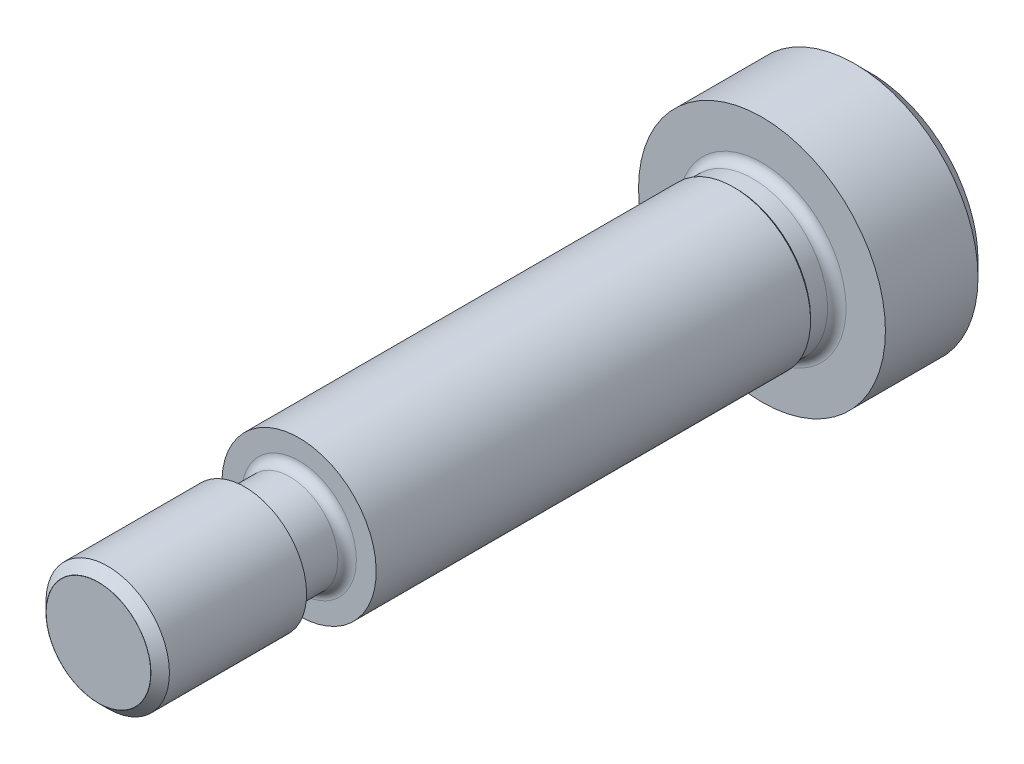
ISO-10303-21;
HEADER;
FILE_DESCRIPTION(('STEP AP214'),'2;1');
FILE_NAME('part.step','',(''),(''),'','','');
FILE_SCHEMA(('AUTOMOTIVE_DESIGN { 1 0 10303 214 1 1 1 1 }'));
ENDSEC;
DATA;
#1=APPLICATION_CONTEXT('core data for automotive mechanical design processes');
#2=APPLICATION_PROTOCOL_DEFINITION('international standard','automotive_design',2000,#1);
#3=PRODUCT_CONTEXT('',#1,'mechanical');
#4=PRODUCT('Part','Part','',(#3));
#5=PRODUCT_RELATED_PRODUCT_CATEGORY('part','',(#4));
#6=PRODUCT_DEFINITION_FORMATION('','',#4);
#7=PRODUCT_DEFINITION_CONTEXT('part definition',#1,'design');
#8=PRODUCT_DEFINITION('design','',#6,#7);
#9=PRODUCT_DEFINITION_SHAPE('','',#8);
#10=(LENGTH_UNIT() NAMED_UNIT(*) SI_UNIT(.MILLI.,.METRE.));
#11=(NAMED_UNIT(*) PLANE_ANGLE_UNIT() SI_UNIT($,.RADIAN.));
#12=(NAMED_UNIT(*) SI_UNIT($,.STERADIAN.) SOLID_ANGLE_UNIT());
#13=UNCERTAINTY_MEASURE_WITH_UNIT(LENGTH_MEASURE(1.E-05),#10,'distance_accuracy_value','');
#14=(GEOMETRIC_REPRESENTATION_CONTEXT(3) GLOBAL_UNCERTAINTY_ASSIGNED_CONTEXT((#13)) GLOBAL_UNIT_ASSIGNED_CONTEXT((#10,
#11,#12)) REPRESENTATION_CONTEXT('',''));
#15=CARTESIAN_POINT('',(0.,0.,0.));
#16=DIRECTION('',(0.,0.,1.));
#17=DIRECTION('',(1.,0.,0.));
#18=AXIS2_PLACEMENT_3D('',#15,#16,#17);
#19=CARTESIAN_POINT('',(0.,8.,0.));
#20=DIRECTION('',(0.,0.,-1.));
#21=DIRECTION('',(0.,1.,0.));
#22=AXIS2_PLACEMENT_3D('',#19,#20,#21);
#23=PLANE('',#22);
#24=CARTESIAN_POINT('',(0.,0.,0.));
#25=DIRECTION('',(0.,0.,1.));
#26=DIRECTION('',(0.,-1.,0.));
#27=AXIS2_PLACEMENT_3D('',#24,#25,#26);
#28=CIRCLE('',#27,5.45);
#29=CARTESIAN_POINT('',(0.,-5.45,0.));
#30=VERTEX_POINT('',#29);
#31=EDGE_CURVE('E211',#30,#30,#28,.T.);
#32=ORIENTED_EDGE('',*,*,#31,.F.);
#33=EDGE_LOOP('',(#32));
#34=FACE_BOUND('',#33,.T.);
#35=CARTESIAN_POINT('',(0.,0.,0.));
#36=DIRECTION('',(0.,0.,1.));
#37=DIRECTION('',(0.,-1.,0.));
#38=AXIS2_PLACEMENT_3D('',#35,#36,#37);
#39=CIRCLE('',#38,8.);
#40=CARTESIAN_POINT('',(0.,-8.,0.));
#41=VERTEX_POINT('',#40);
#42=EDGE_CURVE('E149',#41,#41,#39,.T.);
#43=ORIENTED_EDGE('',*,*,#42,.T.);
#44=EDGE_LOOP('',(#43));
#45=FACE_BOUND('',#44,.T.);
#46=ADVANCED_FACE('F36',(#34,#45),#23,.F.);
#47=CARTESIAN_POINT('',(0.,0.,0.6));
#48=DIRECTION('',(0.,0.,1.));
#49=DIRECTION('',(0.,-1.,0.));
#50=AXIS2_PLACEMENT_3D('',#47,#48,#49);
#51=TOROIDAL_SURFACE('',#50,5.45,0.6);
#52=CARTESIAN_POINT('',(0.,0.,0.6));
#53=DIRECTION('',(0.,0.,1.));
#54=DIRECTION('',(0.,-1.,0.));
#55=AXIS2_PLACEMENT_3D('',#52,#53,#54);
#56=CIRCLE('',#55,4.85);
#57=CARTESIAN_POINT('',(0.,-4.85,0.6));
#58=VERTEX_POINT('',#57);
#59=EDGE_CURVE('E208',#58,#58,#56,.T.);
#60=ORIENTED_EDGE('',*,*,#59,.F.);
#61=EDGE_LOOP('',(#60));
#62=FACE_BOUND('',#61,.T.);
#63=ORIENTED_EDGE('',*,*,#31,.T.);
#64=EDGE_LOOP('',(#63));
#65=FACE_BOUND('',#64,.T.);
#66=ADVANCED_FACE('F274',(#62,#65),#51,.F.);
#67=CARTESIAN_POINT('',(0.,0.,-1.49784845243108));
#68=DIRECTION('',(0.,0.,1.));
#69=DIRECTION('',(0.,-1.,0.));
#70=AXIS2_PLACEMENT_3D('',#67,#68,#69);
#71=CYLINDRICAL_SURFACE('',#70,4.85);
#72=CARTESIAN_POINT('',(0.,0.,1.7));
#73=DIRECTION('',(0.,0.,1.));
#74=DIRECTION('',(0.,-1.,0.));
#75=AXIS2_PLACEMENT_3D('',#72,#73,#74);
#76=CIRCLE('',#75,4.85);
#77=CARTESIAN_POINT('',(0.,-4.85,1.7));
#78=VERTEX_POINT('',#77);
#79=EDGE_CURVE('E205',#78,#78,#76,.T.);
#80=ORIENTED_EDGE('',*,*,#79,.F.);
#81=EDGE_LOOP('',(#80));
#82=FACE_BOUND('',#81,.T.);
#83=ORIENTED_EDGE('',*,*,#59,.T.);
#84=EDGE_LOOP('',(#83));
#85=FACE_BOUND('',#84,.T.);
#86=ADVANCED_FACE('F279',(#82,#85),#71,.T.);
#87=CARTESIAN_POINT('',(0.,0.,1.7));
#88=DIRECTION('',(0.,0.,1.));
#89=DIRECTION('',(0.,-1.,0.));
#90=AXIS2_PLACEMENT_3D('',#87,#88,#89);
#91=CONICAL_SURFACE('',#90,4.85,0.785398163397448);
#92=CARTESIAN_POINT('',(0.,0.,1.85));
#93=DIRECTION('',(0.,0.,1.));
#94=DIRECTION('',(0.,-1.,0.));
#95=AXIS2_PLACEMENT_3D('',#92,#93,#94);
#96=CIRCLE('',#95,5.);
#97=CARTESIAN_POINT('',(0.,-5.,1.85));
#98=VERTEX_POINT('',#97);
#99=EDGE_CURVE('E202',#98,#98,#96,.T.);
#100=ORIENTED_EDGE('',*,*,#99,.F.);
#101=EDGE_LOOP('',(#100));
#102=FACE_BOUND('',#101,.T.);
#103=ORIENTED_EDGE('',*,*,#79,.T.);
#104=EDGE_LOOP('',(#103));
#105=FACE_BOUND('',#104,.T.);
#106=ADVANCED_FACE('F346',(#102,#105),#91,.T.);
#107=CARTESIAN_POINT('',(0.,0.,-1.49784845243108));
#108=DIRECTION('',(0.,0.,1.));
#109=DIRECTION('',(0.,-1.,0.));
#110=AXIS2_PLACEMENT_3D('',#107,#108,#109);
#111=CYLINDRICAL_SURFACE('',#110,5.);
#112=CARTESIAN_POINT('',(0.,0.,30.));
#113=DIRECTION('',(0.,0.,1.));
#114=DIRECTION('',(0.,-1.,0.));
#115=AXIS2_PLACEMENT_3D('',#112,#113,#114);
#116=CIRCLE('',#115,5.);
#117=CARTESIAN_POINT('',(0.,-5.,30.));
#118=VERTEX_POINT('',#117);
#119=EDGE_CURVE('E199',#118,#118,#116,.T.);
#120=ORIENTED_EDGE('',*,*,#119,.F.);
#121=EDGE_LOOP('',(#120));
#122=FACE_BOUND('',#121,.T.);
#123=ORIENTED_EDGE('',*,*,#99,.T.);
#124=EDGE_LOOP('',(#123));
#125=FACE_BOUND('',#124,.T.);
#126=ADVANCED_FACE('F342',(#122,#125),#111,.T.);
#127=CARTESIAN_POINT('',(0.,5.,30.));
#128=DIRECTION('',(0.,0.,-1.));
#129=DIRECTION('',(0.,1.,0.));
#130=AXIS2_PLACEMENT_3D('',#127,#128,#129);
#131=PLANE('',#130);
#132=CARTESIAN_POINT('',(0.,0.,30.));
#133=DIRECTION('',(0.,0.,1.));
#134=DIRECTION('',(0.,-1.,0.));
#135=AXIS2_PLACEMENT_3D('',#132,#133,#134);
#136=CIRCLE('',#135,3.715);
#137=CARTESIAN_POINT('',(0.,-3.715,30.));
#138=VERTEX_POINT('',#137);
#139=EDGE_CURVE('E196',#138,#138,#136,.T.);
#140=ORIENTED_EDGE('',*,*,#139,.F.);
#141=EDGE_LOOP('',(#140));
#142=FACE_BOUND('',#141,.T.);
#143=ORIENTED_EDGE('',*,*,#119,.T.);
#144=EDGE_LOOP('',(#143));
#145=FACE_BOUND('',#144,.T.);
#146=ADVANCED_FACE('F338',(#142,#145),#131,.F.);
#147=CARTESIAN_POINT('',(0.,0.,30.6));
#148=DIRECTION('',(0.,0.,1.));
#149=DIRECTION('',(0.,-1.,0.));
#150=AXIS2_PLACEMENT_3D('',#147,#148,#149);
#151=TOROIDAL_SURFACE('',#150,3.715,0.600000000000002);
#152=CARTESIAN_POINT('',(0.,0.,30.6));
#153=DIRECTION('',(0.,0.,1.));
#154=DIRECTION('',(0.,-1.,0.));
#155=AXIS2_PLACEMENT_3D('',#152,#153,#154);
#156=CIRCLE('',#155,3.115);
#157=CARTESIAN_POINT('',(0.,-3.115,30.6));
#158=VERTEX_POINT('',#157);
#159=EDGE_CURVE('E193',#158,#158,#156,.T.);
#160=ORIENTED_EDGE('',*,*,#159,.F.);
#161=EDGE_LOOP('',(#160));
#162=FACE_BOUND('',#161,.T.);
#163=ORIENTED_EDGE('',*,*,#139,.T.);
#164=EDGE_LOOP('',(#163));
#165=FACE_BOUND('',#164,.T.);
#166=ADVANCED_FACE('F334',(#162,#165),#151,.F.);
#167=CARTESIAN_POINT('',(0.,0.,-1.49784845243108));
#168=DIRECTION('',(0.,0.,1.));
#169=DIRECTION('',(0.,-1.,0.));
#170=AXIS2_PLACEMENT_3D('',#167,#168,#169);
#171=CYLINDRICAL_SURFACE('',#170,3.115);
#172=CARTESIAN_POINT('',(0.,0.,33.));
#173=DIRECTION('',(0.,0.,1.));
#174=DIRECTION('',(0.,-1.,0.));
#175=AXIS2_PLACEMENT_3D('',#172,#173,#174);
#176=CIRCLE('',#175,3.115);
#177=CARTESIAN_POINT('',(0.,-3.115,33.));
#178=VERTEX_POINT('',#177);
#179=EDGE_CURVE('E190',#178,#178,#176,.T.);
#180=ORIENTED_EDGE('',*,*,#179,.F.);
#181=EDGE_LOOP('',(#180));
#182=FACE_BOUND('',#181,.T.);
#183=ORIENTED_EDGE('',*,*,#159,.T.);
#184=EDGE_LOOP('',(#183));
#185=FACE_BOUND('',#184,.T.);
#186=ADVANCED_FACE('F330',(#182,#185),#171,.T.);
#187=CARTESIAN_POINT('',(0.,0.,33.));
#188=DIRECTION('',(0.,0.,1.));
#189=DIRECTION('',(0.,-1.,0.));
#190=AXIS2_PLACEMENT_3D('',#187,#188,#189);
#191=CONICAL_SURFACE('',#190,3.115,1.04719755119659);
#192=CARTESIAN_POINT('',(0.,0.,33.5109549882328));
#193=DIRECTION('',(0.,0.,1.));
#194=DIRECTION('',(0.,-1.,0.));
#195=AXIS2_PLACEMENT_3D('',#192,#193,#194);
#196=CIRCLE('',#195,4.);
#197=CARTESIAN_POINT('',(0.,-4.,33.5109549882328));
#198=VERTEX_POINT('',#197);
#199=EDGE_CURVE('E187',#198,#198,#196,.T.);
#200=ORIENTED_EDGE('',*,*,#199,.F.);
#201=EDGE_LOOP('',(#200));
#202=FACE_BOUND('',#201,.T.);
#203=ORIENTED_EDGE('',*,*,#179,.T.);
#204=EDGE_LOOP('',(#203));
#205=FACE_BOUND('',#204,.T.);
#206=ADVANCED_FACE('F326',(#202,#205),#191,.T.);
#207=CARTESIAN_POINT('',(0.,0.,-1.49784845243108));
#208=DIRECTION('',(0.,0.,1.));
#209=DIRECTION('',(0.,-1.,0.));
#210=AXIS2_PLACEMENT_3D('',#207,#208,#209);
#211=CYLINDRICAL_SURFACE('',#210,4.);
#212=CARTESIAN_POINT('',(0.,0.,42.4));
#213=DIRECTION('',(0.,0.,1.));
#214=DIRECTION('',(0.,-1.,0.));
#215=AXIS2_PLACEMENT_3D('',#212,#213,#214);
#216=CIRCLE('',#215,4.);
#217=CARTESIAN_POINT('',(0.,-4.,42.4));
#218=VERTEX_POINT('',#217);
#219=EDGE_CURVE('E184',#218,#218,#216,.T.);
#220=ORIENTED_EDGE('',*,*,#219,.F.);
#221=EDGE_LOOP('',(#220));
#222=FACE_BOUND('',#221,.T.);
#223=ORIENTED_EDGE('',*,*,#199,.T.);
#224=EDGE_LOOP('',(#223));
#225=FACE_BOUND('',#224,.T.);
#226=ADVANCED_FACE('F322',(#222,#225),#211,.T.);
#227=CARTESIAN_POINT('',(0.,0.,42.4));
#228=DIRECTION('',(0.,0.,-1.));
#229=DIRECTION('',(0.,1.,0.));
#230=AXIS2_PLACEMENT_3D('',#227,#228,#229);
#231=CONICAL_SURFACE('',#230,4.,0.785398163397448);
#232=CARTESIAN_POINT('',(0.,0.,43.));
#233=DIRECTION('',(0.,0.,1.));
#234=DIRECTION('',(0.,-1.,0.));
#235=AXIS2_PLACEMENT_3D('',#232,#233,#234);
#236=CIRCLE('',#235,3.4);
#237=CARTESIAN_POINT('',(0.,-3.4,43.));
#238=VERTEX_POINT('',#237);
#239=EDGE_CURVE('E181',#238,#238,#236,.T.);
#240=ORIENTED_EDGE('',*,*,#239,.F.);
#241=EDGE_LOOP('',(#240));
#242=FACE_BOUND('',#241,.T.);
#243=ORIENTED_EDGE('',*,*,#219,.T.);
#244=EDGE_LOOP('',(#243));
#245=FACE_BOUND('',#244,.T.);
#246=ADVANCED_FACE('F318',(#242,#245),#231,.T.);
#247=CARTESIAN_POINT('',(0.,0.,-1.49784845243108));
#248=DIRECTION('',(0.,0.,1.));
#249=DIRECTION('',(0.,-1.,0.));
#250=AXIS2_PLACEMENT_3D('',#247,#248,#249);
#251=CYLINDRICAL_SURFACE('',#250,3.4);
#252=CARTESIAN_POINT('',(0.,0.,33.1760918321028));
#253=DIRECTION('',(0.,0.,1.));
#254=DIRECTION('',(0.,-1.,0.));
#255=AXIS2_PLACEMENT_3D('',#252,#253,#254);
#256=CIRCLE('',#255,3.4);
#257=CARTESIAN_POINT('',(0.,-3.4,33.1760918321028));
#258=VERTEX_POINT('',#257);
#259=EDGE_CURVE('E178',#258,#258,#256,.T.);
#260=ORIENTED_EDGE('',*,*,#259,.F.);
#261=EDGE_LOOP('',(#260));
#262=FACE_BOUND('',#261,.T.);
#263=ORIENTED_EDGE('',*,*,#239,.T.);
#264=EDGE_LOOP('',(#263));
#265=FACE_BOUND('',#264,.T.);
#266=ADVANCED_FACE('F314',(#262,#265),#251,.F.);
#267=CARTESIAN_POINT('',(0.,0.,33.1760918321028));
#268=DIRECTION('',(0.,0.,1.));
#269=DIRECTION('',(0.,-1.,0.));
#270=AXIS2_PLACEMENT_3D('',#267,#268,#269);
#271=CONICAL_SURFACE('',#270,3.4,1.04719755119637);
#272=CARTESIAN_POINT('',(0.,0.,33.1703183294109));
#273=DIRECTION('',(0.,0.,1.));
#274=DIRECTION('',(0.,-1.,0.));
#275=AXIS2_PLACEMENT_3D('',#272,#273,#274);
#276=CIRCLE('',#275,3.38999999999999);
#277=CARTESIAN_POINT('',(0.,-3.38999999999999,33.1703183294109));
#278=VERTEX_POINT('',#277);
#279=EDGE_CURVE('E175',#278,#278,#276,.T.);
#280=ORIENTED_EDGE('',*,*,#279,.F.);
#281=EDGE_LOOP('',(#280));
#282=FACE_BOUND('',#281,.T.);
#283=ORIENTED_EDGE('',*,*,#259,.T.);
#284=EDGE_LOOP('',(#283));
#285=FACE_BOUND('',#284,.T.);
#286=ADVANCED_FACE('F310',(#282,#285),#271,.F.);
#287=CARTESIAN_POINT('',(0.,0.,-1.49784845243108));
#288=DIRECTION('',(0.,0.,1.));
#289=DIRECTION('',(0.,-1.,0.));
#290=AXIS2_PLACEMENT_3D('',#287,#288,#289);
#291=CYLINDRICAL_SURFACE('',#290,3.38999999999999);
#292=CARTESIAN_POINT('',(0.,0.,43.));
#293=DIRECTION('',(0.,0.,1.));
#294=DIRECTION('',(0.,-1.,0.));
#295=AXIS2_PLACEMENT_3D('',#292,#293,#294);
#296=CIRCLE('',#295,3.38999999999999);
#297=CARTESIAN_POINT('',(0.,-3.38999999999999,43.));
#298=VERTEX_POINT('',#297);
#299=EDGE_CURVE('E171',#298,#298,#296,.T.);
#300=ORIENTED_EDGE('',*,*,#299,.F.);
#301=EDGE_LOOP('',(#300));
#302=FACE_BOUND('',#301,.T.);
#303=ORIENTED_EDGE('',*,*,#279,.T.);
#304=EDGE_LOOP('',(#303));
#305=FACE_BOUND('',#304,.T.);
#306=ADVANCED_FACE('F302',(#302,#305),#291,.T.);
#307=CARTESIAN_POINT('',(0.,3.38999999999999,43.));
#308=DIRECTION('',(0.,0.,-1.));
#309=DIRECTION('',(0.,1.,0.));
#310=AXIS2_PLACEMENT_3D('',#307,#308,#309);
#311=PLANE('',#310);
#312=ORIENTED_EDGE('',*,*,#299,.T.);
#313=EDGE_LOOP('',(#312));
#314=FACE_BOUND('',#313,.T.);
#315=ADVANCED_FACE('F297',(#314),#311,.F.);
#316=CARTESIAN_POINT('',(0.,2.5,-7.));
#317=DIRECTION('',(0.,0.,1.));
#318=DIRECTION('',(0.,-1.,0.));
#319=AXIS2_PLACEMENT_3D('',#316,#317,#318);
#320=PLANE('',#319);
#321=CARTESIAN_POINT('',(0.,0.,-7.));
#322=DIRECTION('',(0.,0.,1.));
#323=DIRECTION('',(0.,-1.,0.));
#324=AXIS2_PLACEMENT_3D('',#321,#322,#323);
#325=CIRCLE('',#324,7.00000000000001);
#326=CARTESIAN_POINT('',(0.,-7.00000000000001,-7.));
#327=VERTEX_POINT('',#326);
#328=EDGE_CURVE('E166',#327,#327,#325,.T.);
#329=ORIENTED_EDGE('',*,*,#328,.F.);
#330=EDGE_LOOP('',(#329));
#331=FACE_BOUND('',#330,.T.);
#332=DIRECTION('',(0.5,-0.866025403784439,0.));
#333=VECTOR('',#332,1.);
#334=CARTESIAN_POINT('',(-3.24759526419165,0.625000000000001,-7.));
#335=LINE('',#334,#333);
#336=CARTESIAN_POINT('',(-2.88675134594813,0.,-7.));
#337=VERTEX_POINT('',#336);
#338=CARTESIAN_POINT('',(-1.44337567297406,-2.50000000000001,-7.));
#339=VERTEX_POINT('',#338);
#340=EDGE_CURVE('E57',#337,#339,#335,.T.);
#341=ORIENTED_EDGE('',*,*,#340,.T.);
#342=DIRECTION('',(1.,0.,0.));
#343=VECTOR('',#342,1.);
#344=CARTESIAN_POINT('',(0.,-2.5,-7.));
#345=LINE('',#344,#343);
#346=CARTESIAN_POINT('',(1.44337567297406,-2.5,-7.00000000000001));
#347=VERTEX_POINT('',#346);
#348=EDGE_CURVE('E11',#339,#347,#345,.T.);
#349=ORIENTED_EDGE('',*,*,#348,.T.);
#350=DIRECTION('',(0.5,0.866025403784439,0.));
#351=VECTOR('',#350,1.);
#352=CARTESIAN_POINT('',(3.24759526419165,0.625000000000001,-7.));
#353=LINE('',#352,#351);
#354=CARTESIAN_POINT('',(2.88675134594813,0.,-7.));
#355=VERTEX_POINT('',#354);
#356=EDGE_CURVE('E43',#347,#355,#353,.T.);
#357=ORIENTED_EDGE('',*,*,#356,.T.);
#358=DIRECTION('',(-0.5,0.866025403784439,0.));
#359=VECTOR('',#358,1.);
#360=CARTESIAN_POINT('',(1.08253175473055,3.125,-7.));
#361=LINE('',#360,#359);
#362=CARTESIAN_POINT('',(1.44337567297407,2.5,-6.99999999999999));
#363=VERTEX_POINT('',#362);
#364=EDGE_CURVE('E219',#355,#363,#361,.T.);
#365=ORIENTED_EDGE('',*,*,#364,.T.);
#366=DIRECTION('',(-1.,0.,0.));
#367=VECTOR('',#366,1.);
#368=CARTESIAN_POINT('',(0.,2.5,-7.));
#369=LINE('',#368,#367);
#370=CARTESIAN_POINT('',(-1.44337567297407,2.5,-6.99999999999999));
#371=VERTEX_POINT('',#370);
#372=EDGE_CURVE('E217',#363,#371,#369,.T.);
#373=ORIENTED_EDGE('',*,*,#372,.T.);
#374=DIRECTION('',(-0.5,-0.866025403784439,0.));
#375=VECTOR('',#374,1.);
#376=CARTESIAN_POINT('',(-1.08253175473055,3.125,-7.));
#377=LINE('',#376,#375);
#378=EDGE_CURVE('E215',#371,#337,#377,.T.);
#379=ORIENTED_EDGE('',*,*,#378,.T.);
#380=EDGE_LOOP('',(#341,#349,#357,#365,#373,#379));
#381=FACE_BOUND('',#380,.T.);
#382=ADVANCED_FACE('F222',(#331,#381),#320,.F.);
#383=CARTESIAN_POINT('',(0.,0.,-7.));
#384=DIRECTION('',(0.,0.,1.));
#385=DIRECTION('',(0.,-1.,0.));
#386=AXIS2_PLACEMENT_3D('',#383,#384,#385);
#387=CONICAL_SURFACE('',#386,7.00000000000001,0.785398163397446);
#388=CARTESIAN_POINT('',(0.,0.,-6.));
#389=DIRECTION('',(0.,0.,1.));
#390=DIRECTION('',(0.,-1.,0.));
#391=AXIS2_PLACEMENT_3D('',#388,#389,#390);
#392=CIRCLE('',#391,8.);
#393=CARTESIAN_POINT('',(0.,-8.,-6.));
#394=VERTEX_POINT('',#393);
#395=EDGE_CURVE('E163',#394,#394,#392,.T.);
#396=ORIENTED_EDGE('',*,*,#395,.F.);
#397=EDGE_LOOP('',(#396));
#398=FACE_BOUND('',#397,.T.);
#399=ORIENTED_EDGE('',*,*,#328,.T.);
#400=EDGE_LOOP('',(#399));
#401=FACE_BOUND('',#400,.T.);
#402=ADVANCED_FACE('F287',(#398,#401),#387,.T.);
#403=CARTESIAN_POINT('',(0.,0.,-1.49784845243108));
#404=DIRECTION('',(0.,0.,1.));
#405=DIRECTION('',(0.,-1.,0.));
#406=AXIS2_PLACEMENT_3D('',#403,#404,#405);
#407=CYLINDRICAL_SURFACE('',#406,8.);
#408=ORIENTED_EDGE('',*,*,#42,.F.);
#409=EDGE_LOOP('',(#408));
#410=FACE_BOUND('',#409,.T.);
#411=ORIENTED_EDGE('',*,*,#395,.T.);
#412=EDGE_LOOP('',(#411));
#413=FACE_BOUND('',#412,.T.);
#414=ADVANCED_FACE('F272',(#410,#413),#407,.T.);
#415=CARTESIAN_POINT('',(0.,0.,-3.00000000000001));
#416=DIRECTION('',(0.,0.,-1.));
#417=DIRECTION('',(0.,1.,0.));
#418=AXIS2_PLACEMENT_3D('',#415,#416,#417);
#419=PLANE('',#418);
#420=CARTESIAN_POINT('',(0.,0.,-3.));
#421=DIRECTION('',(0.,0.,1.));
#422=DIRECTION('',(0.,-1.,0.));
#423=AXIS2_PLACEMENT_3D('',#420,#421,#422);
#424=CIRCLE('',#423,2.5);
#425=CARTESIAN_POINT('',(0.,2.49999999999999,-3.));
#426=VERTEX_POINT('',#425);
#427=CARTESIAN_POINT('',(-2.16506350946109,1.25,-3.));
#428=VERTEX_POINT('',#427);
#429=EDGE_CURVE('E244',#426,#428,#424,.T.);
#430=ORIENTED_EDGE('',*,*,#429,.T.);
#431=DIRECTION('',(0.5,0.866025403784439,0.));
#432=VECTOR('',#431,1.);
#433=CARTESIAN_POINT('',(-2.88675134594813,0.,-3.00000000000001));
#434=LINE('',#433,#432);
#435=CARTESIAN_POINT('',(-1.44337567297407,2.49999999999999,-3.));
#436=VERTEX_POINT('',#435);
#437=EDGE_CURVE('E132',#428,#436,#434,.T.);
#438=ORIENTED_EDGE('',*,*,#437,.T.);
#439=DIRECTION('',(1.,0.,0.));
#440=VECTOR('',#439,1.);
#441=CARTESIAN_POINT('',(-1.44337567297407,2.49999999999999,-3.));
#442=LINE('',#441,#440);
#443=EDGE_CURVE('E139',#436,#426,#442,.T.);
#444=ORIENTED_EDGE('',*,*,#443,.T.);
#445=EDGE_LOOP('',(#430,#438,#444));
#446=FACE_BOUND('',#445,.T.);
#447=ADVANCED_FACE('F258',(#446),#419,.T.);
#448=CARTESIAN_POINT('',(-2.1650635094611,-1.25,-3.00000000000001));
#449=VERTEX_POINT('',#448);
#450=EDGE_CURVE('E246',#428,#449,#424,.T.);
#451=ORIENTED_EDGE('',*,*,#450,.T.);
#452=DIRECTION('',(-0.5,0.866025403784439,0.));
#453=VECTOR('',#452,1.);
#454=CARTESIAN_POINT('',(-1.44337567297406,-2.50000000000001,-3.00000000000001));
#455=LINE('',#454,#453);
#456=CARTESIAN_POINT('',(-2.88675134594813,0.,-3.00000000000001));
#457=VERTEX_POINT('',#456);
#458=EDGE_CURVE('E131',#449,#457,#455,.T.);
#459=ORIENTED_EDGE('',*,*,#458,.T.);
#460=EDGE_CURVE('E134',#457,#428,#434,.T.);
#461=ORIENTED_EDGE('',*,*,#460,.T.);
#462=EDGE_LOOP('',(#451,#459,#461));
#463=FACE_BOUND('',#462,.T.);
#464=ADVANCED_FACE('F251',(#463),#419,.T.);
#465=CARTESIAN_POINT('',(0.,-2.50000000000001,-3.00000000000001));
#466=VERTEX_POINT('',#465);
#467=EDGE_CURVE('E114',#449,#466,#424,.T.);
#468=ORIENTED_EDGE('',*,*,#467,.T.);
#469=DIRECTION('',(-1.,0.,0.));
#470=VECTOR('',#469,1.);
#471=CARTESIAN_POINT('',(1.44337567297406,-2.50000000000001,-3.00000000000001));
#472=LINE('',#471,#470);
#473=CARTESIAN_POINT('',(-1.44337567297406,-2.50000000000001,-3.00000000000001));
#474=VERTEX_POINT('',#473);
#475=EDGE_CURVE('E108',#466,#474,#472,.T.);
#476=ORIENTED_EDGE('',*,*,#475,.T.);
#477=EDGE_CURVE('E112',#474,#449,#455,.T.);
#478=ORIENTED_EDGE('',*,*,#477,.T.);
#479=EDGE_LOOP('',(#468,#476,#478));
#480=FACE_BOUND('',#479,.T.);
#481=ADVANCED_FACE('F110',(#480),#419,.T.);
#482=CARTESIAN_POINT('',(2.1650635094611,-1.25,-3.00000000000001));
#483=VERTEX_POINT('',#482);
#484=EDGE_CURVE('E169',#466,#483,#424,.T.);
#485=ORIENTED_EDGE('',*,*,#484,.T.);
#486=DIRECTION('',(-0.5,-0.866025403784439,0.));
#487=VECTOR('',#486,1.);
#488=CARTESIAN_POINT('',(2.88675134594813,0.,-3.00000000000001));
#489=LINE('',#488,#487);
#490=CARTESIAN_POINT('',(1.44337567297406,-2.50000000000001,-3.00000000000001));
#491=VERTEX_POINT('',#490);
#492=EDGE_CURVE('E144',#483,#491,#489,.T.);
#493=ORIENTED_EDGE('',*,*,#492,.T.);
#494=EDGE_CURVE('E118',#491,#466,#472,.T.);
#495=ORIENTED_EDGE('',*,*,#494,.T.);
#496=EDGE_LOOP('',(#485,#493,#495));
#497=FACE_BOUND('',#496,.T.);
#498=ADVANCED_FACE('F269',(#497),#419,.T.);
#499=CARTESIAN_POINT('',(2.1650635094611,1.25,-3.));
#500=VERTEX_POINT('',#499);
#501=EDGE_CURVE('E172',#483,#500,#424,.T.);
#502=ORIENTED_EDGE('',*,*,#501,.T.);
#503=DIRECTION('',(0.5,-0.866025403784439,0.));
#504=VECTOR('',#503,1.);
#505=CARTESIAN_POINT('',(1.44337567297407,2.49999999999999,-3.));
#506=LINE('',#505,#504);
#507=CARTESIAN_POINT('',(2.88675134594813,0.,-3.00000000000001));
#508=VERTEX_POINT('',#507);
#509=EDGE_CURVE('E142',#500,#508,#506,.T.);
#510=ORIENTED_EDGE('',*,*,#509,.T.);
#511=EDGE_CURVE('E126',#508,#483,#489,.T.);
#512=ORIENTED_EDGE('',*,*,#511,.T.);
#513=EDGE_LOOP('',(#502,#510,#512));
#514=FACE_BOUND('',#513,.T.);
#515=ADVANCED_FACE('F236',(#514),#419,.T.);
#516=EDGE_CURVE('E243',#500,#426,#424,.T.);
#517=ORIENTED_EDGE('',*,*,#516,.T.);
#518=CARTESIAN_POINT('',(1.44337567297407,2.49999999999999,-3.));
#519=VERTEX_POINT('',#518);
#520=EDGE_CURVE('E138',#426,#519,#442,.T.);
#521=ORIENTED_EDGE('',*,*,#520,.T.);
#522=EDGE_CURVE('E50',#519,#500,#506,.T.);
#523=ORIENTED_EDGE('',*,*,#522,.T.);
#524=EDGE_LOOP('',(#517,#521,#523));
#525=FACE_BOUND('',#524,.T.);
#526=ADVANCED_FACE('F261',(#525),#419,.T.);
#527=CARTESIAN_POINT('',(1.44337567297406,-2.50000000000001,-3.00000000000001));
#528=DIRECTION('',(0.,-1.,0.));
#529=DIRECTION('',(0.,0.,-1.));
#530=AXIS2_PLACEMENT_3D('',#527,#528,#529);
#531=PLANE('',#530);
#532=ORIENTED_EDGE('',*,*,#494,.F.);
#533=DIRECTION('',(0.,0.,-1.));
#534=VECTOR('',#533,1.);
#535=CARTESIAN_POINT('',(1.44337567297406,-2.50000000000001,-3.00000000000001));
#536=LINE('',#535,#534);
#537=EDGE_CURVE('E147',#491,#347,#536,.T.);
#538=ORIENTED_EDGE('',*,*,#537,.T.);
#539=ORIENTED_EDGE('',*,*,#348,.F.);
#540=DIRECTION('',(0.,0.,-1.));
#541=VECTOR('',#540,1.);
#542=CARTESIAN_POINT('',(-1.44337567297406,-2.50000000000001,-3.00000000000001));
#543=LINE('',#542,#541);
#544=EDGE_CURVE('E121',#474,#339,#543,.T.);
#545=ORIENTED_EDGE('',*,*,#544,.F.);
#546=ORIENTED_EDGE('',*,*,#475,.F.);
#547=EDGE_LOOP('',(#532,#538,#539,#545,#546));
#548=FACE_BOUND('',#547,.T.);
#549=ADVANCED_FACE('F122',(#548),#531,.F.);
#550=CARTESIAN_POINT('',(2.88675134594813,0.,-3.00000000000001));
#551=DIRECTION('',(0.866025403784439,-0.5,0.));
#552=DIRECTION('',(0.5,0.866025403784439,0.));
#553=AXIS2_PLACEMENT_3D('',#550,#551,#552);
#554=PLANE('',#553);
#555=ORIENTED_EDGE('',*,*,#511,.F.);
#556=DIRECTION('',(0.,0.,-1.));
#557=VECTOR('',#556,1.);
#558=CARTESIAN_POINT('',(2.88675134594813,0.,-3.00000000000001));
#559=LINE('',#558,#557);
#560=EDGE_CURVE('E150',#508,#355,#559,.T.);
#561=ORIENTED_EDGE('',*,*,#560,.T.);
#562=ORIENTED_EDGE('',*,*,#356,.F.);
#563=ORIENTED_EDGE('',*,*,#537,.F.);
#564=ORIENTED_EDGE('',*,*,#492,.F.);
#565=EDGE_LOOP('',(#555,#561,#562,#563,#564));
#566=FACE_BOUND('',#565,.T.);
#567=ADVANCED_FACE('F231',(#566),#554,.F.);
#568=CARTESIAN_POINT('',(1.44337567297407,2.49999999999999,-3.));
#569=DIRECTION('',(0.866025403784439,0.5,0.));
#570=DIRECTION('',(-0.5,0.866025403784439,0.));
#571=AXIS2_PLACEMENT_3D('',#568,#569,#570);
#572=PLANE('',#571);
#573=ORIENTED_EDGE('',*,*,#522,.F.);
#574=DIRECTION('',(0.,0.,-1.));
#575=VECTOR('',#574,1.);
#576=CARTESIAN_POINT('',(1.44337567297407,2.49999999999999,-3.));
#577=LINE('',#576,#575);
#578=EDGE_CURVE('E153',#519,#363,#577,.T.);
#579=ORIENTED_EDGE('',*,*,#578,.T.);
#580=ORIENTED_EDGE('',*,*,#364,.F.);
#581=ORIENTED_EDGE('',*,*,#560,.F.);
#582=ORIENTED_EDGE('',*,*,#509,.F.);
#583=EDGE_LOOP('',(#573,#579,#580,#581,#582));
#584=FACE_BOUND('',#583,.T.);
#585=ADVANCED_FACE('F228',(#584),#572,.F.);
#586=CARTESIAN_POINT('',(-1.44337567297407,2.49999999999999,-3.));
#587=DIRECTION('',(0.,1.,0.));
#588=DIRECTION('',(0.,0.,1.));
#589=AXIS2_PLACEMENT_3D('',#586,#587,#588);
#590=PLANE('',#589);
#591=ORIENTED_EDGE('',*,*,#443,.F.);
#592=DIRECTION('',(0.,0.,-1.));
#593=VECTOR('',#592,1.);
#594=CARTESIAN_POINT('',(-1.44337567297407,2.49999999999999,-3.));
#595=LINE('',#594,#593);
#596=EDGE_CURVE('E156',#436,#371,#595,.T.);
#597=ORIENTED_EDGE('',*,*,#596,.T.);
#598=ORIENTED_EDGE('',*,*,#372,.F.);
#599=ORIENTED_EDGE('',*,*,#578,.F.);
#600=ORIENTED_EDGE('',*,*,#520,.F.);
#601=EDGE_LOOP('',(#591,#597,#598,#599,#600));
#602=FACE_BOUND('',#601,.T.);
#603=ADVANCED_FACE('F260',(#602),#590,.F.);
#604=CARTESIAN_POINT('',(-2.88675134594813,0.,-3.00000000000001));
#605=DIRECTION('',(-0.866025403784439,0.5,0.));
#606=DIRECTION('',(-0.5,-0.866025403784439,0.));
#607=AXIS2_PLACEMENT_3D('',#604,#605,#606);
#608=PLANE('',#607);
#609=ORIENTED_EDGE('',*,*,#460,.F.);
#610=DIRECTION('',(0.,0.,-1.));
#611=VECTOR('',#610,1.);
#612=CARTESIAN_POINT('',(-2.88675134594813,0.,-3.00000000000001));
#613=LINE('',#612,#611);
#614=EDGE_CURVE('E125',#457,#337,#613,.T.);
#615=ORIENTED_EDGE('',*,*,#614,.T.);
#616=ORIENTED_EDGE('',*,*,#378,.F.);
#617=ORIENTED_EDGE('',*,*,#596,.F.);
#618=ORIENTED_EDGE('',*,*,#437,.F.);
#619=EDGE_LOOP('',(#609,#615,#616,#617,#618));
#620=FACE_BOUND('',#619,.T.);
#621=ADVANCED_FACE('F254',(#620),#608,.F.);
#622=CARTESIAN_POINT('',(-1.44337567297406,-2.50000000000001,-3.00000000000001));
#623=DIRECTION('',(-0.866025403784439,-0.5,0.));
#624=DIRECTION('',(0.5,-0.866025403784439,0.));
#625=AXIS2_PLACEMENT_3D('',#622,#623,#624);
#626=PLANE('',#625);
#627=ORIENTED_EDGE('',*,*,#477,.F.);
#628=ORIENTED_EDGE('',*,*,#544,.T.);
#629=ORIENTED_EDGE('',*,*,#340,.F.);
#630=ORIENTED_EDGE('',*,*,#614,.F.);
#631=ORIENTED_EDGE('',*,*,#458,.F.);
#632=EDGE_LOOP('',(#627,#628,#629,#630,#631));
#633=FACE_BOUND('',#632,.T.);
#634=ADVANCED_FACE('F129',(#633),#626,.F.);
#635=CARTESIAN_POINT('',(0.,0.,-1.49784845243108));
#636=DIRECTION('',(0.,0.,-1.));
#637=DIRECTION('',(0.,1.,0.));
#638=AXIS2_PLACEMENT_3D('',#635,#636,#637);
#639=CONICAL_SURFACE('',#638,0.,1.02974425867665);
#640=ORIENTED_EDGE('',*,*,#484,.F.);
#641=ORIENTED_EDGE('',*,*,#467,.F.);
#642=ORIENTED_EDGE('',*,*,#450,.F.);
#643=ORIENTED_EDGE('',*,*,#429,.F.);
#644=ORIENTED_EDGE('',*,*,#516,.F.);
#645=ORIENTED_EDGE('',*,*,#501,.F.);
#646=EDGE_LOOP('',(#640,#641,#642,#643,#644,#645));
#647=FACE_BOUND('',#646,.T.);
#648=CARTESIAN_POINT('',(0.,0.,-1.49784845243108));
#649=VERTEX_POINT('',#648);
#650=VERTEX_LOOP('',#649);
#651=FACE_BOUND('',#650,.T.);
#652=ADVANCED_FACE('F240',(#647,#651),#639,.F.);
#653=CLOSED_SHELL('',(#46,#66,#86,#106,#126,#146,#166,#186,#206,#226,#246,#266,#286,#306,#315,
#382,#402,#414,#447,#464,#481,#498,#515,#526,#549,#567,#585,#603,#621,#634,#652));
#654=MANIFOLD_SOLID_BREP('B2',#653);
#655=ADVANCED_BREP_SHAPE_REPRESENTATION('',(#18,#654),#14);
#656=SHAPE_DEFINITION_REPRESENTATION(#9,#655);
ENDSEC;
END-ISO-10303-21;
